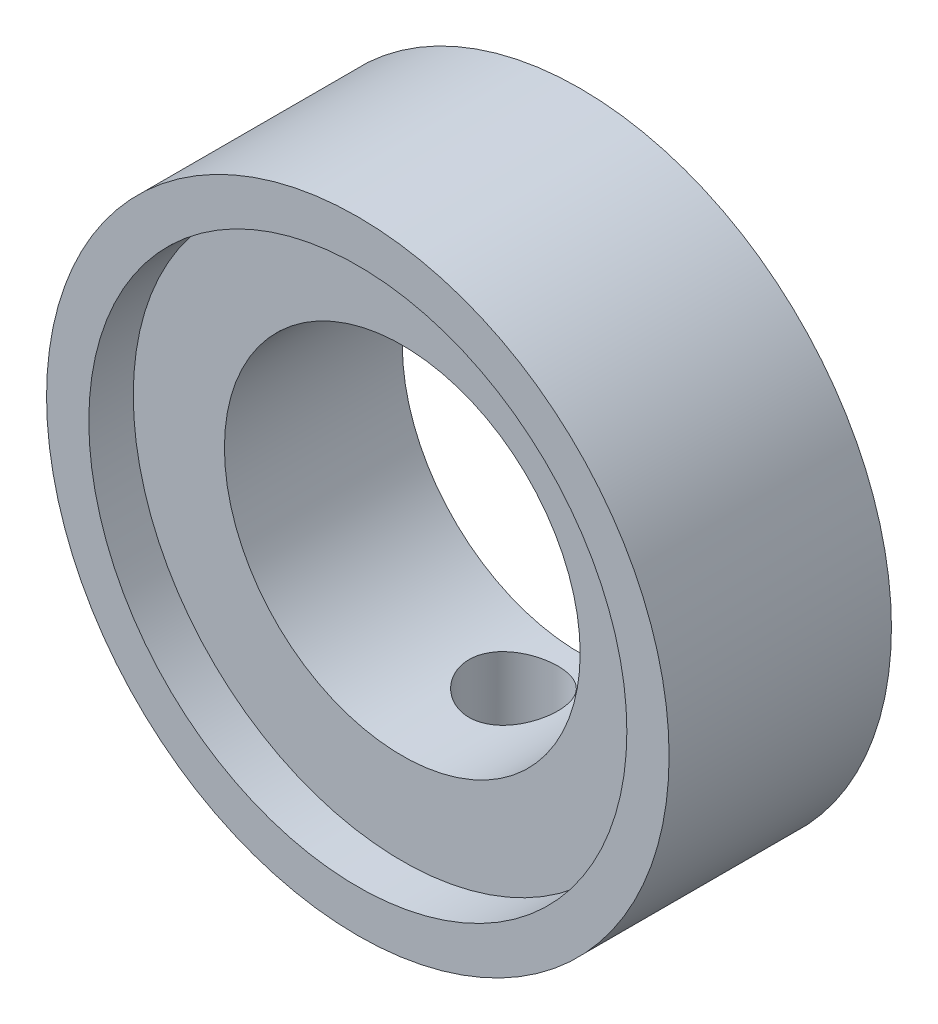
ISO-10303-21;
HEADER;
FILE_DESCRIPTION(('STEP AP214'),'2;1');
FILE_NAME('part.step','',(''),(''),'','','');
FILE_SCHEMA(('AUTOMOTIVE_DESIGN { 1 0 10303 214 1 1 1 1 }'));
ENDSEC;
DATA;
#1=APPLICATION_CONTEXT('core data for automotive mechanical design processes');
#2=APPLICATION_PROTOCOL_DEFINITION('international standard','automotive_design',2000,#1);
#3=PRODUCT_CONTEXT('',#1,'mechanical');
#4=PRODUCT('Part','Part','',(#3));
#5=PRODUCT_RELATED_PRODUCT_CATEGORY('part','',(#4));
#6=PRODUCT_DEFINITION_FORMATION('','',#4);
#7=PRODUCT_DEFINITION_CONTEXT('part definition',#1,'design');
#8=PRODUCT_DEFINITION('design','',#6,#7);
#9=PRODUCT_DEFINITION_SHAPE('','',#8);
#10=(LENGTH_UNIT() NAMED_UNIT(*) SI_UNIT(.MILLI.,.METRE.));
#11=(NAMED_UNIT(*) PLANE_ANGLE_UNIT() SI_UNIT($,.RADIAN.));
#12=(NAMED_UNIT(*) SI_UNIT($,.STERADIAN.) SOLID_ANGLE_UNIT());
#13=UNCERTAINTY_MEASURE_WITH_UNIT(LENGTH_MEASURE(1.E-05),#10,'distance_accuracy_value','');
#14=(GEOMETRIC_REPRESENTATION_CONTEXT(3) GLOBAL_UNCERTAINTY_ASSIGNED_CONTEXT((#13)) GLOBAL_UNIT_ASSIGNED_CONTEXT((#10,
#11,#12)) REPRESENTATION_CONTEXT('',''));
#15=CARTESIAN_POINT('',(0.,0.,0.));
#16=DIRECTION('',(0.,0.,1.));
#17=DIRECTION('',(1.,0.,0.));
#18=AXIS2_PLACEMENT_3D('',#15,#16,#17);
#19=CARTESIAN_POINT('',(0.,0.,44.54));
#20=DIRECTION('',(0.,0.,-1.));
#21=DIRECTION('',(-1.,0.,0.));
#22=AXIS2_PLACEMENT_3D('',#19,#20,#21);
#23=CYLINDRICAL_SURFACE('',#22,13.1);
#24=CARTESIAN_POINT('',(0.,-13.1,36.3525));
#25=CARTESIAN_POINT('',(0.180946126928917,-13.0999969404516,36.3524949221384));
#26=CARTESIAN_POINT('',(0.361948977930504,-13.0962136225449,36.3374534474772));
#27=CARTESIAN_POINT('',(0.718767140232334,-13.0814878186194,36.277775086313));
#28=CARTESIAN_POINT('',(0.894579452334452,-13.0705412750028,36.2331214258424));
#29=CARTESIAN_POINT('',(1.23581223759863,-13.042701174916,36.1157409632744));
#30=CARTESIAN_POINT('',(1.40124491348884,-13.0258147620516,36.043047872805));
#31=CARTESIAN_POINT('',(1.71756748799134,-12.9878933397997,35.8717706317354));
#32=CARTESIAN_POINT('',(1.86845689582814,-12.9668581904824,35.7731856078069));
#33=CARTESIAN_POINT('',(2.15451754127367,-12.9224385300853,35.5507782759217));
#34=CARTESIAN_POINT('',(2.28934658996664,-12.8990177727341,35.4265230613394));
#35=CARTESIAN_POINT('',(2.53648515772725,-12.8527073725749,35.1572293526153));
#36=CARTESIAN_POINT('',(2.64879213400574,-12.8298177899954,35.0121885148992));
#37=CARTESIAN_POINT('',(2.84930795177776,-12.7867959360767,34.7027837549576));
#38=CARTESIAN_POINT('',(2.93713400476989,-12.7667096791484,34.5381647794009));
#39=CARTESIAN_POINT('',(3.08373325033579,-12.7320973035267,34.1959159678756));
#40=CARTESIAN_POINT('',(3.14251108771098,-12.7175702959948,34.0182882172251));
#41=CARTESIAN_POINT('',(3.22817806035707,-12.696093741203,33.658826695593));
#42=CARTESIAN_POINT('',(3.25568245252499,-12.6889982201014,33.4771484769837));
#43=CARTESIAN_POINT('',(3.279938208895,-12.6827510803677,33.1116286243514));
#44=CARTESIAN_POINT('',(3.27669457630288,-12.6835981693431,32.9277873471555));
#45=CARTESIAN_POINT('',(3.24003724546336,-12.6930093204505,32.5678754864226));
#46=CARTESIAN_POINT('',(3.20735670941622,-12.7013858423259,32.3917245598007));
#47=CARTESIAN_POINT('',(3.11392280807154,-12.7246131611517,32.0474883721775));
#48=CARTESIAN_POINT('',(3.05316744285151,-12.7394644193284,31.8794036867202));
#49=CARTESIAN_POINT('',(2.90468369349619,-12.7741399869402,31.5541053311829));
#50=CARTESIAN_POINT('',(2.81668922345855,-12.794012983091,31.3970185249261));
#51=CARTESIAN_POINT('',(2.61641120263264,-12.8364653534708,31.0995774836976));
#52=CARTESIAN_POINT('',(2.50412340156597,-12.8590452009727,30.9592261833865));
#53=CARTESIAN_POINT('',(2.25464847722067,-12.905156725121,30.6950387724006));
#54=CARTESIAN_POINT('',(2.11684266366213,-12.928697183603,30.5717876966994));
#55=CARTESIAN_POINT('',(1.82223601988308,-12.9734969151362,30.3500336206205));
#56=CARTESIAN_POINT('',(1.66543460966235,-12.9947561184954,30.2515313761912));
#57=CARTESIAN_POINT('',(1.33645302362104,-13.0327038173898,30.0818562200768));
#58=CARTESIAN_POINT('',(1.16422187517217,-13.0493763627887,30.0107783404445));
#59=CARTESIAN_POINT('',(0.809745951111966,-13.0761561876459,29.8987472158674));
#60=CARTESIAN_POINT('',(0.62750309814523,-13.0862647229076,29.8577882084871));
#61=CARTESIAN_POINT('',(0.263178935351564,-13.0985917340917,29.8080509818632));
#62=CARTESIAN_POINT('',(0.0812128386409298,-13.1010055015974,29.7984760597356));
#63=CARTESIAN_POINT('',(-0.281721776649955,-13.0982272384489,29.8095936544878));
#64=CARTESIAN_POINT('',(-0.462690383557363,-13.0930358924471,29.8302834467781));
#65=CARTESIAN_POINT('',(-0.815724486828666,-13.0757558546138,29.9006864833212));
#66=CARTESIAN_POINT('',(-0.9878821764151,-13.0637705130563,29.9499650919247));
#67=CARTESIAN_POINT('',(-1.32147842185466,-13.0342534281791,30.0756504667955));
#68=CARTESIAN_POINT('',(-1.48291589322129,-13.0167211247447,30.1520599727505));
#69=CARTESIAN_POINT('',(-1.79365884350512,-12.9775872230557,30.3313822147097));
#70=CARTESIAN_POINT('',(-1.94269821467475,-12.9559189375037,30.4347411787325));
#71=CARTESIAN_POINT('',(-2.22159977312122,-12.911021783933,30.6644579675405));
#72=CARTESIAN_POINT('',(-2.35145864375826,-12.8877926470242,30.7908197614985));
#73=CARTESIAN_POINT('',(-2.59159607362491,-12.8416888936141,31.0666542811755));
#74=CARTESIAN_POINT('',(-2.70131577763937,-12.8188369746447,31.2166181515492));
#75=CARTESIAN_POINT('',(-2.89403182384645,-12.776711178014,31.5332995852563));
#76=CARTESIAN_POINT('',(-2.97702935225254,-12.7574371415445,31.700016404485));
#77=CARTESIAN_POINT('',(-3.11332726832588,-12.7248617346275,32.0445774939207));
#78=CARTESIAN_POINT('',(-3.16680359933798,-12.7115250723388,32.2223486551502));
#79=CARTESIAN_POINT('',(-3.24300469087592,-12.6923005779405,32.5847427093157));
#80=CARTESIAN_POINT('',(-3.26573617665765,-12.6864111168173,32.769364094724));
#81=CARTESIAN_POINT('',(-3.27945092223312,-12.6828720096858,33.1345309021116));
#82=CARTESIAN_POINT('',(-3.2713274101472,-12.6849905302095,33.3150410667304));
#83=CARTESIAN_POINT('',(-3.22560705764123,-12.696692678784,33.6720301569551));
#84=CARTESIAN_POINT('',(-3.18801080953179,-12.7062761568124,33.8485091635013));
#85=CARTESIAN_POINT('',(-3.08490004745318,-12.7316991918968,34.1914551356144));
#86=CARTESIAN_POINT('',(-3.01955306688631,-12.7475011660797,34.3579754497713));
#87=CARTESIAN_POINT('',(-2.86292839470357,-12.7835859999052,34.6778077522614));
#88=CARTESIAN_POINT('',(-2.77164710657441,-12.8038694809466,34.8311179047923));
#89=CARTESIAN_POINT('',(-2.56294458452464,-12.8472930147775,35.1244942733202));
#90=CARTESIAN_POINT('',(-2.44490357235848,-12.8704937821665,35.2641106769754));
#91=CARTESIAN_POINT('',(-2.18724012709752,-12.9167752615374,35.5218443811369));
#92=CARTESIAN_POINT('',(-2.04761257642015,-12.9398559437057,35.6399565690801));
#93=CARTESIAN_POINT('',(-1.74768756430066,-12.9837954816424,35.853414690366));
#94=CARTESIAN_POINT('',(-1.58706155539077,-13.0046065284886,35.9483095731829));
#95=CARTESIAN_POINT('',(-1.25163089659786,-13.0411575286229,36.1095986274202));
#96=CARTESIAN_POINT('',(-1.07683651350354,-13.0569011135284,36.1760132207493));
#97=CARTESIAN_POINT('',(-0.751962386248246,-13.0792159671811,36.2685984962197));
#98=CARTESIAN_POINT('',(-0.603430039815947,-13.0869564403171,36.2999935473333));
#99=CARTESIAN_POINT('',(-0.303278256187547,-13.0973495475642,36.3419456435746));
#100=CARTESIAN_POINT('',(-0.151659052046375,-13.1000025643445,36.3525042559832));
#101=CARTESIAN_POINT('',(0.,-13.1,36.3525));
#102=B_SPLINE_CURVE_WITH_KNOTS('',3,(#24,#25,#26,#27,#28,#29,#30,#31,#32,#33,#34,#35,#36,#37,
#38,#39,#40,#41,#42,#43,#44,#45,#46,#47,#48,#49,#50,#51,#52,#53,#54,#55,#56,#57,#58,#59,#60,#61,
#62,#63,#64,#65,#66,#67,#68,#69,#70,#71,#72,#73,#74,#75,#76,#77,#78,#79,#80,#81,#82,#83,#84,#85,
#86,#87,#88,#89,#90,#91,#92,#93,#94,#95,#96,#97,#98,#99,#100,#101),.UNSPECIFIED.,.T.,.F.,(4,2,2,
2,2,2,2,2,2,2,2,2,2,2,2,2,2,2,2,2,2,2,2,2,2,2,2,2,2,2,2,2,2,2,2,2,2,2,4),(0.,0.542282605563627,
1.08487265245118,1.62681236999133,2.1687703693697,2.7207485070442,3.27278892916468,
3.83303047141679,4.39318240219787,4.94211244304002,5.49095316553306,6.02649118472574,
6.562067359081,7.10304985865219,7.64412708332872,8.20063277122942,8.75715545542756,
9.31558966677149,9.8739170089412,10.4179564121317,10.9619468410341,11.497875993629,
12.0338592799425,12.5793533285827,13.1249415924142,13.6839217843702,14.2428771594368,
14.798464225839,15.3539297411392,15.8934392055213,16.4329378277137,16.9692247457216,
17.5055860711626,18.0559390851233,18.6064227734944,19.166876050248,19.7269267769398,
20.1814723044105,20.6359836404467),.UNSPECIFIED.);
#103=CARTESIAN_POINT('',(0.,-13.1,36.3525));
#104=VERTEX_POINT('',#103);
#105=EDGE_CURVE('E63',#104,#104,#102,.T.);
#106=ORIENTED_EDGE('',*,*,#105,.F.);
#107=EDGE_LOOP('',(#106));
#108=FACE_BOUND('',#107,.T.);
#109=CARTESIAN_POINT('',(0.,0.,28.165));
#110=DIRECTION('',(0.,0.,1.));
#111=DIRECTION('',(1.,0.,0.));
#112=AXIS2_PLACEMENT_3D('',#109,#110,#111);
#113=CIRCLE('',#112,13.1);
#114=CARTESIAN_POINT('',(13.1,0.,28.165));
#115=VERTEX_POINT('',#114);
#116=EDGE_CURVE('E45',#115,#115,#113,.T.);
#117=ORIENTED_EDGE('',*,*,#116,.F.);
#118=EDGE_LOOP('',(#117));
#119=FACE_BOUND('',#118,.T.);
#120=CARTESIAN_POINT('',(0.,0.,41.265));
#121=DIRECTION('',(0.,0.,1.));
#122=DIRECTION('',(1.,0.,0.));
#123=AXIS2_PLACEMENT_3D('',#120,#121,#122);
#124=CIRCLE('',#123,13.1);
#125=CARTESIAN_POINT('',(13.1,0.,41.265));
#126=VERTEX_POINT('',#125);
#127=EDGE_CURVE('E50',#126,#126,#124,.T.);
#128=ORIENTED_EDGE('',*,*,#127,.T.);
#129=EDGE_LOOP('',(#128));
#130=FACE_BOUND('',#129,.T.);
#131=ADVANCED_FACE('F33',(#108,#119,#130),#23,.F.);
#132=CARTESIAN_POINT('',(0.,0.,28.165));
#133=DIRECTION('',(0.,0.,1.));
#134=DIRECTION('',(1.,0.,0.));
#135=AXIS2_PLACEMENT_3D('',#132,#133,#134);
#136=PLANE('',#135);
#137=ORIENTED_EDGE('',*,*,#116,.T.);
#138=EDGE_LOOP('',(#137));
#139=FACE_BOUND('',#138,.T.);
#140=CARTESIAN_POINT('',(0.,0.,28.165));
#141=DIRECTION('',(0.,0.,1.));
#142=DIRECTION('',(1.,0.,0.));
#143=AXIS2_PLACEMENT_3D('',#140,#141,#142);
#144=CIRCLE('',#143,22.925);
#145=CARTESIAN_POINT('',(22.925,0.,28.165));
#146=VERTEX_POINT('',#145);
#147=EDGE_CURVE('E70',#146,#146,#144,.T.);
#148=ORIENTED_EDGE('',*,*,#147,.F.);
#149=EDGE_LOOP('',(#148));
#150=FACE_BOUND('',#149,.T.);
#151=ADVANCED_FACE('F93',(#139,#150),#136,.F.);
#152=CARTESIAN_POINT('',(0.,0.,44.54));
#153=DIRECTION('',(0.,0.,1.));
#154=DIRECTION('',(1.,0.,0.));
#155=AXIS2_PLACEMENT_3D('',#152,#153,#154);
#156=PLANE('',#155);
#157=CARTESIAN_POINT('',(0.,0.,44.54));
#158=DIRECTION('',(0.,0.,1.));
#159=DIRECTION('',(1.,0.,0.));
#160=AXIS2_PLACEMENT_3D('',#157,#158,#159);
#161=CIRCLE('',#160,19.81375);
#162=CARTESIAN_POINT('',(19.81375,0.,44.54));
#163=VERTEX_POINT('',#162);
#164=EDGE_CURVE('E58',#163,#163,#161,.T.);
#165=ORIENTED_EDGE('',*,*,#164,.F.);
#166=EDGE_LOOP('',(#165));
#167=FACE_BOUND('',#166,.T.);
#168=CARTESIAN_POINT('',(0.,0.,44.54));
#169=DIRECTION('',(0.,0.,1.));
#170=DIRECTION('',(1.,0.,0.));
#171=AXIS2_PLACEMENT_3D('',#168,#169,#170);
#172=CIRCLE('',#171,22.925);
#173=CARTESIAN_POINT('',(22.925,0.,44.54));
#174=VERTEX_POINT('',#173);
#175=EDGE_CURVE('E10',#174,#174,#172,.T.);
#176=ORIENTED_EDGE('',*,*,#175,.T.);
#177=EDGE_LOOP('',(#176));
#178=FACE_BOUND('',#177,.T.);
#179=ADVANCED_FACE('F89',(#167,#178),#156,.T.);
#180=CARTESIAN_POINT('',(0.,0.,44.54));
#181=DIRECTION('',(0.,0.,-1.));
#182=DIRECTION('',(-1.,0.,0.));
#183=AXIS2_PLACEMENT_3D('',#180,#181,#182);
#184=CYLINDRICAL_SURFACE('',#183,22.925);
#185=CARTESIAN_POINT('',(0.,-22.925,36.3525));
#186=CARTESIAN_POINT('',(0.182959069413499,-22.9249971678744,36.3524923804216));
#187=CARTESIAN_POINT('',(0.36602679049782,-22.9227867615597,36.337116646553));
#188=CARTESIAN_POINT('',(0.727052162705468,-22.9141817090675,36.2760315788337));
#189=CARTESIAN_POINT('',(0.905004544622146,-22.907782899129,36.230292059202));
#190=CARTESIAN_POINT('',(1.25052166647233,-22.8915206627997,36.1098681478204));
#191=CARTESIAN_POINT('',(1.4180938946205,-22.8816597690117,36.0352049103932));
#192=CARTESIAN_POINT('',(1.73830335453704,-22.8595651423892,35.8591030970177));
#193=CARTESIAN_POINT('',(1.89094280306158,-22.8473317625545,35.7576685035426));
#194=CARTESIAN_POINT('',(2.1780670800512,-22.8217569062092,35.5301338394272));
#195=CARTESIAN_POINT('',(2.31243030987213,-22.8084088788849,35.4038810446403));
#196=CARTESIAN_POINT('',(2.55813948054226,-22.7821608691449,35.1306223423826));
#197=CARTESIAN_POINT('',(2.66948414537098,-22.7692609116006,34.9836152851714));
#198=CARTESIAN_POINT('',(2.8664629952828,-22.7453058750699,34.672211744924));
#199=CARTESIAN_POINT('',(2.95198061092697,-22.7342592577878,34.5077408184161));
#200=CARTESIAN_POINT('',(3.09413305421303,-22.7153503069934,34.1665863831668));
#201=CARTESIAN_POINT('',(3.15076930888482,-22.7074878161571,33.9899034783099));
#202=CARTESIAN_POINT('',(3.23317602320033,-22.6959012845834,33.6306147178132));
#203=CARTESIAN_POINT('',(3.25915387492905,-22.692149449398,33.4480573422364));
#204=CARTESIAN_POINT('',(3.28014862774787,-22.6891244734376,33.081138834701));
#205=CARTESIAN_POINT('',(3.27516714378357,-22.6898510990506,32.8967777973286));
#206=CARTESIAN_POINT('',(3.23455434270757,-22.6956755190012,32.5329443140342));
#207=CARTESIAN_POINT('',(3.19915323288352,-22.7007404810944,32.3534455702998));
#208=CARTESIAN_POINT('',(3.09906609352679,-22.7146196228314,32.002962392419));
#209=CARTESIAN_POINT('',(3.03437930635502,-22.7234338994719,31.8319781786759));
#210=CARTESIAN_POINT('',(2.87731518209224,-22.7438550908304,31.5026727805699));
#211=CARTESIAN_POINT('',(2.78483956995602,-22.7554718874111,31.3443991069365));
#212=CARTESIAN_POINT('',(2.57489291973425,-22.7801819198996,31.04552883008));
#213=CARTESIAN_POINT('',(2.45742039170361,-22.7932752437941,30.9049332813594));
#214=CARTESIAN_POINT('',(2.19954717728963,-22.8196083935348,30.6440754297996));
#215=CARTESIAN_POINT('',(2.05894841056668,-22.8328484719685,30.5240088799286));
#216=CARTESIAN_POINT('',(1.75949099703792,-22.8578729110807,30.3091474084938));
#217=CARTESIAN_POINT('',(1.60063228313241,-22.8696572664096,30.2143525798));
#218=CARTESIAN_POINT('',(1.26900040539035,-22.8904531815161,30.0527183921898));
#219=CARTESIAN_POINT('',(1.09622020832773,-22.8994633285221,29.9858932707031));
#220=CARTESIAN_POINT('',(0.74173296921,-22.9136835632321,29.8822610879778));
#221=CARTESIAN_POINT('',(0.56002647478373,-22.9188938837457,29.8454521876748));
#222=CARTESIAN_POINT('',(0.194535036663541,-22.9248967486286,29.8031556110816));
#223=CARTESIAN_POINT('',(0.0107818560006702,-22.9257272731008,29.7973986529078));
#224=CARTESIAN_POINT('',(-0.355067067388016,-22.9229800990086,29.8166558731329));
#225=CARTESIAN_POINT('',(-0.537162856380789,-22.9194025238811,29.8416691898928));
#226=CARTESIAN_POINT('',(-0.893718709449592,-22.9082646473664,29.9215330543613));
#227=CARTESIAN_POINT('',(-1.06820855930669,-22.9007217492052,29.9762532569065));
#228=CARTESIAN_POINT('',(-1.40553657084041,-22.8824966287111,30.1138407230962));
#229=CARTESIAN_POINT('',(-1.56837422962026,-22.8718142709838,30.1967092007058));
#230=CARTESIAN_POINT('',(-1.87896525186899,-22.8484039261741,30.388878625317));
#231=CARTESIAN_POINT('',(-2.02661128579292,-22.8356628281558,30.4983514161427));
#232=CARTESIAN_POINT('',(-2.30153129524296,-22.8095963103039,30.7403815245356));
#233=CARTESIAN_POINT('',(-2.42880420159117,-22.7962708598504,30.8729400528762));
#234=CARTESIAN_POINT('',(-2.66033759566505,-22.7704180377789,31.1585738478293));
#235=CARTESIAN_POINT('',(-2.76441816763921,-22.7578974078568,31.3117956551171));
#236=CARTESIAN_POINT('',(-2.94536418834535,-22.7351887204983,31.633705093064));
#237=CARTESIAN_POINT('',(-3.02223031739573,-22.7250006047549,31.8023923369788));
#238=CARTESIAN_POINT('',(-3.14628285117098,-22.7081584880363,32.1498944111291));
#239=CARTESIAN_POINT('',(-3.19356598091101,-22.70149298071,32.3286741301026));
#240=CARTESIAN_POINT('',(-3.2574193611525,-22.6924194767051,32.6917386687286));
#241=CARTESIAN_POINT('',(-3.27399151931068,-22.690011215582,32.8760231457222));
#242=CARTESIAN_POINT('',(-3.2759102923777,-22.6897341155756,33.2430738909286));
#243=CARTESIAN_POINT('',(-3.26153970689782,-22.691824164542,33.4258387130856));
#244=CARTESIAN_POINT('',(-3.20258476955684,-22.7002191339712,33.7863248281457));
#245=CARTESIAN_POINT('',(-3.15800044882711,-22.706524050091,33.9640461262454));
#246=CARTESIAN_POINT('',(-3.03998019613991,-22.7226244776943,34.3093343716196));
#247=CARTESIAN_POINT('',(-2.96656218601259,-22.7324178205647,34.476907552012));
#248=CARTESIAN_POINT('',(-2.79298655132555,-22.7543945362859,34.7974030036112));
#249=CARTESIAN_POINT('',(-2.69282819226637,-22.7665779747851,34.9503248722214));
#250=CARTESIAN_POINT('',(-2.46758063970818,-22.7920949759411,35.2386165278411));
#251=CARTESIAN_POINT('',(-2.34228152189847,-22.8054376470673,35.3738215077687));
#252=CARTESIAN_POINT('',(-2.07075222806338,-22.8316923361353,35.6213885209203));
#253=CARTESIAN_POINT('',(-1.92451717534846,-22.8446042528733,35.7337452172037));
#254=CARTESIAN_POINT('',(-1.61441685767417,-22.8686153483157,35.9329193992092));
#255=CARTESIAN_POINT('',(-1.45046756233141,-22.8797051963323,36.0196071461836));
#256=CARTESIAN_POINT('',(-1.11025985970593,-22.8987305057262,36.16408883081));
#257=CARTESIAN_POINT('',(-0.934014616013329,-22.9066692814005,36.2219131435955));
#258=CARTESIAN_POINT('',(-0.630783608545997,-22.9166546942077,36.2936868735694));
#259=CARTESIAN_POINT('',(-0.505682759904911,-22.9197683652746,36.3157087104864));
#260=CARTESIAN_POINT('',(-0.25373868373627,-22.9239419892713,36.3451178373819));
#261=CARTESIAN_POINT('',(-0.12689547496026,-22.9250019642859,36.352505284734));
#262=CARTESIAN_POINT('',(0.,-22.925,36.3525));
#263=B_SPLINE_CURVE_WITH_KNOTS('',3,(#185,#186,#187,#188,#189,#190,#191,#192,#193,#194,#195,
#196,#197,#198,#199,#200,#201,#202,#203,#204,#205,#206,#207,#208,#209,#210,#211,#212,#213,#214,
#215,#216,#217,#218,#219,#220,#221,#222,#223,#224,#225,#226,#227,#228,#229,#230,#231,#232,#233,
#234,#235,#236,#237,#238,#239,#240,#241,#242,#243,#244,#245,#246,#247,#248,#249,#250,#251,#252,
#253,#254,#255,#256,#257,#258,#259,#260,#261,#262),.UNSPECIFIED.,.T.,.F.,(4,2,2,2,2,2,2,2,2,2,2,
2,2,2,2,2,2,2,2,2,2,2,2,2,2,2,2,2,2,2,2,2,2,2,2,2,2,2,4),(0.,0.548413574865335,1.09737316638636,
1.64593201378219,2.19440930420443,2.74637384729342,3.29836898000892,3.85281951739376,
4.40724265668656,4.957893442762,5.50851550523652,6.05500694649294,6.60151252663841,
7.14997403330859,7.69846824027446,8.25193164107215,8.80539707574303,9.35914389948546,
9.91285679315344,10.4617600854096,11.0106480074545,11.5571468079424,12.1036691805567,
12.6538201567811,13.2039999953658,13.7583097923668,14.3126057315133,14.8650797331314,
15.4175194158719,15.9649315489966,16.5123431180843,17.0594149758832,17.6065018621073,
18.1583627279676,18.7103523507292,19.2650860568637,19.8192347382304,20.1996036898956,
20.5799685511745),.UNSPECIFIED.);
#264=CARTESIAN_POINT('',(0.,-22.925,36.3525));
#265=VERTEX_POINT('',#264);
#266=EDGE_CURVE('E38',#265,#265,#263,.T.);
#267=ORIENTED_EDGE('',*,*,#266,.T.);
#268=EDGE_LOOP('',(#267));
#269=FACE_BOUND('',#268,.T.);
#270=ORIENTED_EDGE('',*,*,#175,.F.);
#271=EDGE_LOOP('',(#270));
#272=FACE_BOUND('',#271,.T.);
#273=ORIENTED_EDGE('',*,*,#147,.T.);
#274=EDGE_LOOP('',(#273));
#275=FACE_BOUND('',#274,.T.);
#276=ADVANCED_FACE('F35',(#269,#272,#275),#184,.T.);
#277=CARTESIAN_POINT('',(0.,0.,41.265));
#278=DIRECTION('',(0.,0.,1.));
#279=DIRECTION('',(1.,0.,0.));
#280=AXIS2_PLACEMENT_3D('',#277,#278,#279);
#281=CYLINDRICAL_SURFACE('',#280,19.81375);
#282=CARTESIAN_POINT('',(0.,0.,41.265));
#283=DIRECTION('',(0.,0.,1.));
#284=DIRECTION('',(1.,0.,0.));
#285=AXIS2_PLACEMENT_3D('',#282,#283,#284);
#286=CIRCLE('',#285,19.81375);
#287=CARTESIAN_POINT('',(19.81375,0.,41.265));
#288=VERTEX_POINT('',#287);
#289=EDGE_CURVE('E54',#288,#288,#286,.T.);
#290=ORIENTED_EDGE('',*,*,#289,.F.);
#291=EDGE_LOOP('',(#290));
#292=FACE_BOUND('',#291,.T.);
#293=ORIENTED_EDGE('',*,*,#164,.T.);
#294=EDGE_LOOP('',(#293));
#295=FACE_BOUND('',#294,.T.);
#296=ADVANCED_FACE('F82',(#292,#295),#281,.F.);
#297=CARTESIAN_POINT('',(0.,0.,41.265));
#298=DIRECTION('',(0.,0.,1.));
#299=DIRECTION('',(1.,0.,0.));
#300=AXIS2_PLACEMENT_3D('',#297,#298,#299);
#301=PLANE('',#300);
#302=ORIENTED_EDGE('',*,*,#127,.F.);
#303=EDGE_LOOP('',(#302));
#304=FACE_BOUND('',#303,.T.);
#305=ORIENTED_EDGE('',*,*,#289,.T.);
#306=EDGE_LOOP('',(#305));
#307=FACE_BOUND('',#306,.T.);
#308=ADVANCED_FACE('F78',(#304,#307),#301,.T.);
#309=CARTESIAN_POINT('',(0.,-42.575,33.0775));
#310=DIRECTION('',(0.,1.,0.));
#311=DIRECTION('',(0.,0.,1.));
#312=AXIS2_PLACEMENT_3D('',#309,#310,#311);
#313=CYLINDRICAL_SURFACE('',#312,3.275);
#314=ORIENTED_EDGE('',*,*,#105,.T.);
#315=EDGE_LOOP('',(#314));
#316=FACE_BOUND('',#315,.T.);
#317=ORIENTED_EDGE('',*,*,#266,.F.);
#318=EDGE_LOOP('',(#317));
#319=FACE_BOUND('',#318,.T.);
#320=ADVANCED_FACE('F74',(#316,#319),#313,.F.);
#321=CLOSED_SHELL('',(#131,#151,#179,#276,#296,#308,#320));
#322=MANIFOLD_SOLID_BREP('B2',#321);
#323=ADVANCED_BREP_SHAPE_REPRESENTATION('',(#18,#322),#14);
#324=SHAPE_DEFINITION_REPRESENTATION(#9,#323);
ENDSEC;
END-ISO-10303-21;
